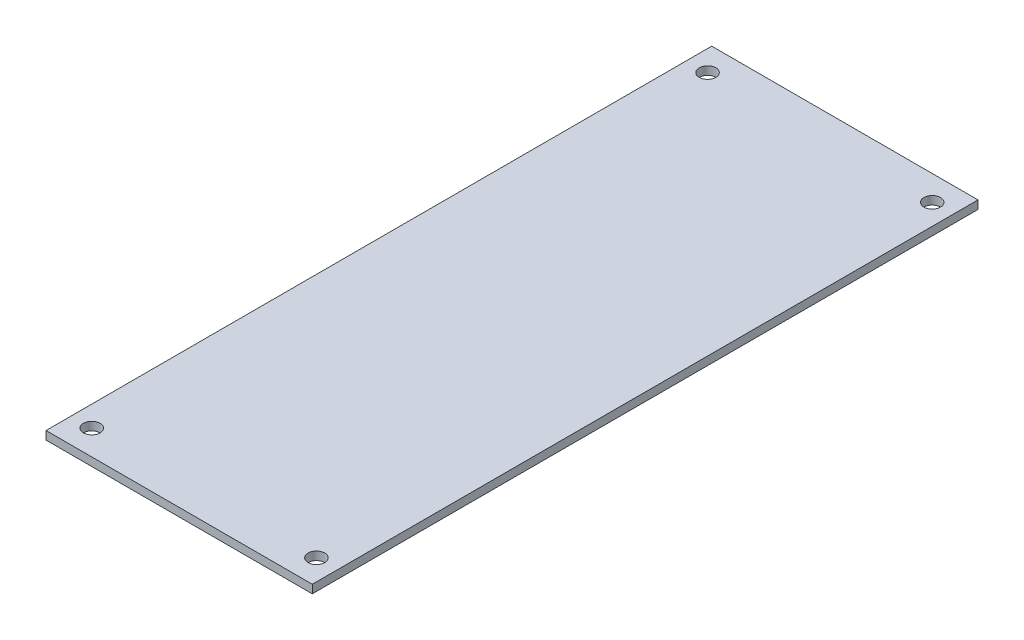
from build123d import *

# Parameters (mm, degrees)
SKETCH1_W           = 50.8
SKETCH1_H           = 127
BOSS_EXTRUDE1_DEPTH = 1.5875
SKETCH2_R           = 1.5875
CUT_EXTRUDE2_DEPTH  = 69.410015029


with BuildPart() as part:
    # Sketch1 → Boss-Extrude1 (new body)
    with BuildSketch(Plane(origin=(0, 0, 0), x_dir=(1, 0, 0), z_dir=(0, 1, 0))):
        Rectangle(SKETCH1_W, SKETCH1_H)
    extrude(amount=BOSS_EXTRUDE1_DEPTH)

    # Sketch2 → Cut-Extrude2 (cut, through all)
    with BuildSketch(Plane(origin=(0, 0, 0), x_dir=(1, 0, 0), z_dir=(0, 1, 0))):
        with Locations(Location((-21.43125, 58.7375, 0), (0, 0, 270))):
            Circle(SKETCH2_R)
        with Locations(Location((21.43125, 58.7375, 0), (0, 0, 270))):
            Circle(SKETCH2_R)
        with Locations(Location((21.43125, -58.7375, 0), (0, 0, 270))):
            Circle(SKETCH2_R)
        with Locations(Location((-21.43125, -58.7375, 0), (0, 0, 270))):
            Circle(SKETCH2_R)
    extrude(amount=CUT_EXTRUDE2_DEPTH, mode=Mode.SUBTRACT)


solid = part.part
